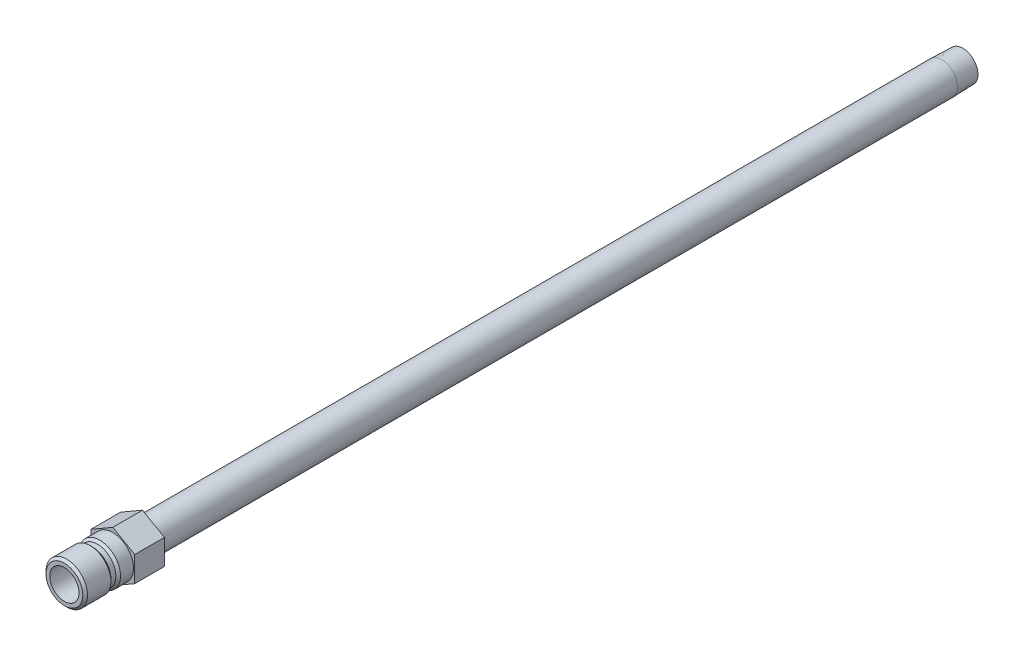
ISO-10303-21;
HEADER;
FILE_DESCRIPTION(('STEP AP214'),'2;1');
FILE_NAME('part.step','',(''),(''),'','','');
FILE_SCHEMA(('AUTOMOTIVE_DESIGN { 1 0 10303 214 1 1 1 1 }'));
ENDSEC;
DATA;
#1=APPLICATION_CONTEXT('core data for automotive mechanical design processes');
#2=APPLICATION_PROTOCOL_DEFINITION('international standard','automotive_design',2000,#1);
#3=PRODUCT_CONTEXT('',#1,'mechanical');
#4=PRODUCT('Part','Part','',(#3));
#5=PRODUCT_RELATED_PRODUCT_CATEGORY('part','',(#4));
#6=PRODUCT_DEFINITION_FORMATION('','',#4);
#7=PRODUCT_DEFINITION_CONTEXT('part definition',#1,'design');
#8=PRODUCT_DEFINITION('design','',#6,#7);
#9=PRODUCT_DEFINITION_SHAPE('','',#8);
#10=(LENGTH_UNIT() NAMED_UNIT(*) SI_UNIT(.MILLI.,.METRE.));
#11=(NAMED_UNIT(*) PLANE_ANGLE_UNIT() SI_UNIT($,.RADIAN.));
#12=(NAMED_UNIT(*) SI_UNIT($,.STERADIAN.) SOLID_ANGLE_UNIT());
#13=UNCERTAINTY_MEASURE_WITH_UNIT(LENGTH_MEASURE(1.E-05),#10,'distance_accuracy_value','');
#14=(GEOMETRIC_REPRESENTATION_CONTEXT(3) GLOBAL_UNCERTAINTY_ASSIGNED_CONTEXT((#13)) GLOBAL_UNIT_ASSIGNED_CONTEXT((#10,
#11,#12)) REPRESENTATION_CONTEXT('',''));
#15=CARTESIAN_POINT('',(0.,0.,0.));
#16=DIRECTION('',(0.,0.,1.));
#17=DIRECTION('',(1.,0.,0.));
#18=AXIS2_PLACEMENT_3D('',#15,#16,#17);
#19=CARTESIAN_POINT('',(0.,0.,-9.652));
#20=DIRECTION('',(0.,0.,-1.));
#21=DIRECTION('',(0.,1.,0.));
#22=AXIS2_PLACEMENT_3D('',#19,#20,#21);
#23=CYLINDRICAL_SURFACE('',#22,4.7625);
#24=CARTESIAN_POINT('',(0.,0.,3.556));
#25=DIRECTION('',(0.,0.,-1.));
#26=DIRECTION('',(0.,1.,0.));
#27=AXIS2_PLACEMENT_3D('',#24,#25,#26);
#28=CIRCLE('',#27,4.7625);
#29=CARTESIAN_POINT('',(0.,4.7625,3.556));
#30=VERTEX_POINT('',#29);
#31=EDGE_CURVE('E137',#30,#30,#28,.T.);
#32=ORIENTED_EDGE('',*,*,#31,.T.);
#33=EDGE_LOOP('',(#32));
#34=FACE_BOUND('',#33,.T.);
#35=CARTESIAN_POINT('',(0.,0.,15.748));
#36=DIRECTION('',(0.,0.,-1.));
#37=DIRECTION('',(0.,1.,0.));
#38=AXIS2_PLACEMENT_3D('',#35,#36,#37);
#39=CIRCLE('',#38,4.7625);
#40=CARTESIAN_POINT('',(0.,4.7625,15.748));
#41=VERTEX_POINT('',#40);
#42=EDGE_CURVE('E41',#41,#41,#39,.T.);
#43=ORIENTED_EDGE('',*,*,#42,.F.);
#44=EDGE_LOOP('',(#43));
#45=FACE_BOUND('',#44,.T.);
#46=ADVANCED_FACE('F33',(#34,#45),#23,.F.);
#47=CARTESIAN_POINT('',(0.,4.7625,15.748));
#48=DIRECTION('',(0.,0.,1.));
#49=DIRECTION('',(0.,-1.,0.));
#50=AXIS2_PLACEMENT_3D('',#47,#48,#49);
#51=PLANE('',#50);
#52=ORIENTED_EDGE('',*,*,#42,.T.);
#53=EDGE_LOOP('',(#52));
#54=FACE_BOUND('',#53,.T.);
#55=CARTESIAN_POINT('',(0.,0.,15.748));
#56=DIRECTION('',(0.,0.,-1.));
#57=DIRECTION('',(0.,1.,0.));
#58=AXIS2_PLACEMENT_3D('',#55,#56,#57);
#59=CIRCLE('',#58,5.9817);
#60=CARTESIAN_POINT('',(0.,5.9817,15.748));
#61=VERTEX_POINT('',#60);
#62=EDGE_CURVE('E175',#61,#61,#59,.T.);
#63=ORIENTED_EDGE('',*,*,#62,.F.);
#64=EDGE_LOOP('',(#63));
#65=FACE_BOUND('',#64,.T.);
#66=ADVANCED_FACE('F180',(#54,#65),#51,.T.);
#67=CARTESIAN_POINT('',(0.,0.,14.986));
#68=DIRECTION('',(0.,0.,-1.));
#69=DIRECTION('',(0.,1.,0.));
#70=AXIS2_PLACEMENT_3D('',#67,#68,#69);
#71=CONICAL_SURFACE('',#70,6.7437,0.785398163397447);
#72=ORIENTED_EDGE('',*,*,#62,.T.);
#73=EDGE_LOOP('',(#72));
#74=FACE_BOUND('',#73,.T.);
#75=CARTESIAN_POINT('',(0.,0.,14.986));
#76=DIRECTION('',(0.,0.,-1.));
#77=DIRECTION('',(0.,1.,0.));
#78=AXIS2_PLACEMENT_3D('',#75,#76,#77);
#79=CIRCLE('',#78,6.7437);
#80=CARTESIAN_POINT('',(0.,6.7437,14.986));
#81=VERTEX_POINT('',#80);
#82=EDGE_CURVE('E172',#81,#81,#79,.T.);
#83=ORIENTED_EDGE('',*,*,#82,.F.);
#84=EDGE_LOOP('',(#83));
#85=FACE_BOUND('',#84,.T.);
#86=ADVANCED_FACE('F188',(#74,#85),#71,.T.);
#87=CARTESIAN_POINT('',(0.,0.,-9.652));
#88=DIRECTION('',(0.,0.,-1.));
#89=DIRECTION('',(0.,1.,0.));
#90=AXIS2_PLACEMENT_3D('',#87,#88,#89);
#91=CYLINDRICAL_SURFACE('',#90,6.7437);
#92=ORIENTED_EDGE('',*,*,#82,.T.);
#93=EDGE_LOOP('',(#92));
#94=FACE_BOUND('',#93,.T.);
#95=CARTESIAN_POINT('',(0.,0.,7.366));
#96=DIRECTION('',(0.,0.,-1.));
#97=DIRECTION('',(0.,1.,0.));
#98=AXIS2_PLACEMENT_3D('',#95,#96,#97);
#99=CIRCLE('',#98,6.7437);
#100=CARTESIAN_POINT('',(0.,6.7437,7.366));
#101=VERTEX_POINT('',#100);
#102=EDGE_CURVE('E169',#101,#101,#99,.T.);
#103=ORIENTED_EDGE('',*,*,#102,.F.);
#104=EDGE_LOOP('',(#103));
#105=FACE_BOUND('',#104,.T.);
#106=ADVANCED_FACE('F237',(#94,#105),#91,.T.);
#107=CARTESIAN_POINT('',(0.,0.,6.604));
#108=DIRECTION('',(0.,0.,1.));
#109=DIRECTION('',(0.,-1.,0.));
#110=AXIS2_PLACEMENT_3D('',#107,#108,#109);
#111=CONICAL_SURFACE('',#110,5.9817,0.785398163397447);
#112=ORIENTED_EDGE('',*,*,#102,.T.);
#113=EDGE_LOOP('',(#112));
#114=FACE_BOUND('',#113,.T.);
#115=CARTESIAN_POINT('',(0.,0.,6.604));
#116=DIRECTION('',(0.,0.,-1.));
#117=DIRECTION('',(0.,1.,0.));
#118=AXIS2_PLACEMENT_3D('',#115,#116,#117);
#119=CIRCLE('',#118,5.9817);
#120=CARTESIAN_POINT('',(0.,5.9817,6.604));
#121=VERTEX_POINT('',#120);
#122=EDGE_CURVE('E166',#121,#121,#119,.T.);
#123=ORIENTED_EDGE('',*,*,#122,.F.);
#124=EDGE_LOOP('',(#123));
#125=FACE_BOUND('',#124,.T.);
#126=ADVANCED_FACE('F233',(#114,#125),#111,.T.);
#127=CARTESIAN_POINT('',(0.,0.,-9.652));
#128=DIRECTION('',(0.,0.,-1.));
#129=DIRECTION('',(0.,1.,0.));
#130=AXIS2_PLACEMENT_3D('',#127,#128,#129);
#131=CYLINDRICAL_SURFACE('',#130,5.9817);
#132=ORIENTED_EDGE('',*,*,#122,.T.);
#133=EDGE_LOOP('',(#132));
#134=FACE_BOUND('',#133,.T.);
#135=CARTESIAN_POINT('',(0.,0.,5.0165));
#136=DIRECTION('',(0.,0.,-1.));
#137=DIRECTION('',(0.,1.,0.));
#138=AXIS2_PLACEMENT_3D('',#135,#136,#137);
#139=CIRCLE('',#138,5.9817);
#140=CARTESIAN_POINT('',(0.,5.9817,5.0165));
#141=VERTEX_POINT('',#140);
#142=EDGE_CURVE('E163',#141,#141,#139,.T.);
#143=ORIENTED_EDGE('',*,*,#142,.F.);
#144=EDGE_LOOP('',(#143));
#145=FACE_BOUND('',#144,.T.);
#146=ADVANCED_FACE('F229',(#134,#145),#131,.T.);
#147=CARTESIAN_POINT('',(0.,0.,4.2545));
#148=DIRECTION('',(0.,0.,-1.));
#149=DIRECTION('',(0.,1.,0.));
#150=AXIS2_PLACEMENT_3D('',#147,#148,#149);
#151=CONICAL_SURFACE('',#150,6.7437,0.785398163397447);
#152=ORIENTED_EDGE('',*,*,#142,.T.);
#153=EDGE_LOOP('',(#152));
#154=FACE_BOUND('',#153,.T.);
#155=CARTESIAN_POINT('',(0.,0.,4.2545));
#156=DIRECTION('',(0.,0.,-1.));
#157=DIRECTION('',(0.,1.,0.));
#158=AXIS2_PLACEMENT_3D('',#155,#156,#157);
#159=CIRCLE('',#158,6.7437);
#160=CARTESIAN_POINT('',(0.,6.7437,4.2545));
#161=VERTEX_POINT('',#160);
#162=EDGE_CURVE('E160',#161,#161,#159,.T.);
#163=ORIENTED_EDGE('',*,*,#162,.F.);
#164=EDGE_LOOP('',(#163));
#165=FACE_BOUND('',#164,.T.);
#166=ADVANCED_FACE('F225',(#154,#165),#151,.T.);
#167=CARTESIAN_POINT('',(0.,0.,-9.652));
#168=DIRECTION('',(0.,0.,-1.));
#169=DIRECTION('',(0.,1.,0.));
#170=AXIS2_PLACEMENT_3D('',#167,#168,#169);
#171=CYLINDRICAL_SURFACE('',#170,6.7437);
#172=CARTESIAN_POINT('',(0.,0.,0.));
#173=DIRECTION('',(0.,0.,1.));
#174=DIRECTION('',(1.,0.,0.));
#175=AXIS2_PLACEMENT_3D('',#172,#173,#174);
#176=CIRCLE('',#175,6.7437);
#177=CARTESIAN_POINT('',(6.7437,0.,0.));
#178=VERTEX_POINT('',#177);
#179=EDGE_CURVE('E11',#178,#178,#176,.F.);
#180=ORIENTED_EDGE('',*,*,#179,.F.);
#181=EDGE_LOOP('',(#180));
#182=FACE_BOUND('',#181,.T.);
#183=ORIENTED_EDGE('',*,*,#162,.T.);
#184=EDGE_LOOP('',(#183));
#185=FACE_BOUND('',#184,.T.);
#186=ADVANCED_FACE('F221',(#182,#185),#171,.T.);
#187=CARTESIAN_POINT('',(0.,6.7437,-9.652));
#188=DIRECTION('',(0.,0.,-1.));
#189=DIRECTION('',(0.,1.,0.));
#190=AXIS2_PLACEMENT_3D('',#187,#188,#189);
#191=PLANE('',#190);
#192=CARTESIAN_POINT('',(0.,0.,-9.652));
#193=DIRECTION('',(0.,0.,-1.));
#194=DIRECTION('',(0.,1.,0.));
#195=AXIS2_PLACEMENT_3D('',#192,#193,#194);
#196=CIRCLE('',#195,5.1435);
#197=CARTESIAN_POINT('',(0.,5.1435,-9.652));
#198=VERTEX_POINT('',#197);
#199=EDGE_CURVE('E157',#198,#198,#196,.T.);
#200=ORIENTED_EDGE('',*,*,#199,.F.);
#201=EDGE_LOOP('',(#200));
#202=FACE_BOUND('',#201,.T.);
#203=DIRECTION('',(-0.866025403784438,-0.5,0.));
#204=VECTOR('',#203,1.);
#205=CARTESIAN_POINT('',(0.,8.21223022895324,-9.652));
#206=LINE('',#205,#204);
#207=CARTESIAN_POINT('',(0.,8.21223022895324,-9.652));
#208=VERTEX_POINT('',#207);
#209=CARTESIAN_POINT('',(-7.112,4.10611511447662,-9.652));
#210=VERTEX_POINT('',#209);
#211=EDGE_CURVE('E135',#208,#210,#206,.T.);
#212=ORIENTED_EDGE('',*,*,#211,.F.);
#213=DIRECTION('',(-0.866025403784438,0.5,0.));
#214=VECTOR('',#213,1.);
#215=CARTESIAN_POINT('',(7.112,4.10611511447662,-9.652));
#216=LINE('',#215,#214);
#217=CARTESIAN_POINT('',(7.112,4.10611511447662,-9.652));
#218=VERTEX_POINT('',#217);
#219=EDGE_CURVE('E110',#218,#208,#216,.T.);
#220=ORIENTED_EDGE('',*,*,#219,.F.);
#221=DIRECTION('',(0.,1.,0.));
#222=VECTOR('',#221,1.);
#223=CARTESIAN_POINT('',(7.112,-4.10611511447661,-9.652));
#224=LINE('',#223,#222);
#225=CARTESIAN_POINT('',(7.112,-4.10611511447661,-9.652));
#226=VERTEX_POINT('',#225);
#227=EDGE_CURVE('E95',#226,#218,#224,.T.);
#228=ORIENTED_EDGE('',*,*,#227,.F.);
#229=DIRECTION('',(0.866025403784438,0.5,0.));
#230=VECTOR('',#229,1.);
#231=CARTESIAN_POINT('',(0.,-8.21223022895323,-9.652));
#232=LINE('',#231,#230);
#233=CARTESIAN_POINT('',(0.,-8.21223022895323,-9.652));
#234=VERTEX_POINT('',#233);
#235=EDGE_CURVE('E108',#234,#226,#232,.T.);
#236=ORIENTED_EDGE('',*,*,#235,.F.);
#237=DIRECTION('',(0.866025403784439,-0.5,0.));
#238=VECTOR('',#237,1.);
#239=CARTESIAN_POINT('',(-7.112,-4.10611511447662,-9.652));
#240=LINE('',#239,#238);
#241=CARTESIAN_POINT('',(-7.112,-4.10611511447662,-9.652));
#242=VERTEX_POINT('',#241);
#243=EDGE_CURVE('E113',#242,#234,#240,.T.);
#244=ORIENTED_EDGE('',*,*,#243,.F.);
#245=DIRECTION('',(0.,-1.,0.));
#246=VECTOR('',#245,1.);
#247=CARTESIAN_POINT('',(-7.112,4.10611511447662,-9.652));
#248=LINE('',#247,#246);
#249=EDGE_CURVE('E115',#210,#242,#248,.T.);
#250=ORIENTED_EDGE('',*,*,#249,.F.);
#251=EDGE_LOOP('',(#212,#220,#228,#236,#244,#250));
#252=FACE_BOUND('',#251,.T.);
#253=ADVANCED_FACE('F106',(#202,#252),#191,.T.);
#254=CARTESIAN_POINT('',(0.,0.,-9.652));
#255=DIRECTION('',(0.,0.,-1.));
#256=DIRECTION('',(0.,1.,0.));
#257=AXIS2_PLACEMENT_3D('',#254,#255,#256);
#258=CYLINDRICAL_SURFACE('',#257,5.14349999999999);
#259=ORIENTED_EDGE('',*,*,#199,.T.);
#260=EDGE_LOOP('',(#259));
#261=FACE_BOUND('',#260,.T.);
#262=CARTESIAN_POINT('',(0.,0.,-269.494));
#263=DIRECTION('',(0.,0.,-1.));
#264=DIRECTION('',(0.,1.,0.));
#265=AXIS2_PLACEMENT_3D('',#262,#263,#264);
#266=CIRCLE('',#265,5.14349999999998);
#267=CARTESIAN_POINT('',(0.,5.1435,-269.494));
#268=VERTEX_POINT('',#267);
#269=EDGE_CURVE('E154',#268,#268,#266,.T.);
#270=ORIENTED_EDGE('',*,*,#269,.F.);
#271=EDGE_LOOP('',(#270));
#272=FACE_BOUND('',#271,.T.);
#273=ADVANCED_FACE('F214',(#261,#272),#258,.T.);
#274=CARTESIAN_POINT('',(0.,0.,-276.352));
#275=DIRECTION('',(0.,0.,1.));
#276=DIRECTION('',(0.,-1.,0.));
#277=AXIS2_PLACEMENT_3D('',#274,#275,#276);
#278=CONICAL_SURFACE('',#277,4.92918877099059,0.0312396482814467);
#279=ORIENTED_EDGE('',*,*,#269,.T.);
#280=EDGE_LOOP('',(#279));
#281=FACE_BOUND('',#280,.T.);
#282=CARTESIAN_POINT('',(0.,0.,-276.352));
#283=DIRECTION('',(0.,0.,-1.));
#284=DIRECTION('',(0.,1.,0.));
#285=AXIS2_PLACEMENT_3D('',#282,#283,#284);
#286=CIRCLE('',#285,4.92918877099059);
#287=CARTESIAN_POINT('',(0.,4.9291887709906,-276.352));
#288=VERTEX_POINT('',#287);
#289=EDGE_CURVE('E151',#288,#288,#286,.T.);
#290=ORIENTED_EDGE('',*,*,#289,.F.);
#291=EDGE_LOOP('',(#290));
#292=FACE_BOUND('',#291,.T.);
#293=ADVANCED_FACE('F210',(#281,#292),#278,.T.);
#294=CARTESIAN_POINT('',(0.,4.9291887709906,-276.352));
#295=DIRECTION('',(0.,0.,-1.));
#296=DIRECTION('',(0.,1.,0.));
#297=AXIS2_PLACEMENT_3D('',#294,#295,#296);
#298=PLANE('',#297);
#299=ORIENTED_EDGE('',*,*,#289,.T.);
#300=EDGE_LOOP('',(#299));
#301=FACE_BOUND('',#300,.T.);
#302=CARTESIAN_POINT('',(0.,0.,-276.352));
#303=DIRECTION('',(0.,0.,-1.));
#304=DIRECTION('',(0.,1.,0.));
#305=AXIS2_PLACEMENT_3D('',#302,#303,#304);
#306=CIRCLE('',#305,3.41629999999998);
#307=CARTESIAN_POINT('',(0.,3.4163,-276.352));
#308=VERTEX_POINT('',#307);
#309=EDGE_CURVE('E148',#308,#308,#306,.T.);
#310=ORIENTED_EDGE('',*,*,#309,.F.);
#311=EDGE_LOOP('',(#310));
#312=FACE_BOUND('',#311,.T.);
#313=ADVANCED_FACE('F203',(#301,#312),#298,.T.);
#314=CARTESIAN_POINT('',(0.,0.,-9.652));
#315=DIRECTION('',(0.,0.,-1.));
#316=DIRECTION('',(0.,1.,0.));
#317=AXIS2_PLACEMENT_3D('',#314,#315,#316);
#318=CYLINDRICAL_SURFACE('',#317,3.41629999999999);
#319=ORIENTED_EDGE('',*,*,#309,.T.);
#320=EDGE_LOOP('',(#319));
#321=FACE_BOUND('',#320,.T.);
#322=CARTESIAN_POINT('',(0.,0.,2.84021276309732));
#323=DIRECTION('',(0.,0.,-1.));
#324=DIRECTION('',(0.,1.,0.));
#325=AXIS2_PLACEMENT_3D('',#322,#323,#324);
#326=CIRCLE('',#325,3.4163);
#327=CARTESIAN_POINT('',(0.,3.4163,2.84021276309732));
#328=VERTEX_POINT('',#327);
#329=EDGE_CURVE('E145',#328,#328,#326,.T.);
#330=ORIENTED_EDGE('',*,*,#329,.F.);
#331=EDGE_LOOP('',(#330));
#332=FACE_BOUND('',#331,.T.);
#333=ADVANCED_FACE('F194',(#321,#332),#318,.F.);
#334=CARTESIAN_POINT('',(0.,0.,3.556));
#335=DIRECTION('',(0.,0.,1.));
#336=DIRECTION('',(0.,-1.,0.));
#337=AXIS2_PLACEMENT_3D('',#334,#335,#336);
#338=CONICAL_SURFACE('',#337,4.7625,1.08210413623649);
#339=ORIENTED_EDGE('',*,*,#329,.T.);
#340=EDGE_LOOP('',(#339));
#341=FACE_BOUND('',#340,.T.);
#342=ORIENTED_EDGE('',*,*,#31,.F.);
#343=EDGE_LOOP('',(#342));
#344=FACE_BOUND('',#343,.T.);
#345=ADVANCED_FACE('F191',(#341,#344),#338,.F.);
#346=CARTESIAN_POINT('',(0.,8.21223022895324,-9.652));
#347=DIRECTION('',(-0.5,0.866025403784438,0.));
#348=DIRECTION('',(-0.866025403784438,-0.5,0.));
#349=AXIS2_PLACEMENT_3D('',#346,#347,#348);
#350=PLANE('',#349);
#351=DIRECTION('',(-0.866025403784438,-0.5,0.));
#352=VECTOR('',#351,1.);
#353=CARTESIAN_POINT('',(0.,8.21223022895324,0.));
#354=LINE('',#353,#352);
#355=CARTESIAN_POINT('',(0.,8.21223022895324,0.));
#356=VERTEX_POINT('',#355);
#357=CARTESIAN_POINT('',(-7.112,4.10611511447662,0.));
#358=VERTEX_POINT('',#357);
#359=EDGE_CURVE('E120',#356,#358,#354,.T.);
#360=ORIENTED_EDGE('',*,*,#359,.F.);
#361=DIRECTION('',(0.,0.,1.));
#362=VECTOR('',#361,1.);
#363=CARTESIAN_POINT('',(0.,8.21223022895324,-9.652));
#364=LINE('',#363,#362);
#365=EDGE_CURVE('E49',#208,#356,#364,.T.);
#366=ORIENTED_EDGE('',*,*,#365,.F.);
#367=ORIENTED_EDGE('',*,*,#211,.T.);
#368=DIRECTION('',(0.,0.,1.));
#369=VECTOR('',#368,1.);
#370=CARTESIAN_POINT('',(-7.112,4.10611511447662,-9.652));
#371=LINE('',#370,#369);
#372=EDGE_CURVE('E84',#210,#358,#371,.T.);
#373=ORIENTED_EDGE('',*,*,#372,.T.);
#374=EDGE_LOOP('',(#360,#366,#367,#373));
#375=FACE_BOUND('',#374,.T.);
#376=ADVANCED_FACE('F193',(#375),#350,.T.);
#377=CARTESIAN_POINT('',(7.112,4.10611511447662,-9.652));
#378=DIRECTION('',(0.5,0.866025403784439,0.));
#379=DIRECTION('',(-0.866025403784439,0.5,0.));
#380=AXIS2_PLACEMENT_3D('',#377,#378,#379);
#381=PLANE('',#380);
#382=DIRECTION('',(-0.866025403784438,0.5,0.));
#383=VECTOR('',#382,1.);
#384=CARTESIAN_POINT('',(7.112,4.10611511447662,0.));
#385=LINE('',#384,#383);
#386=CARTESIAN_POINT('',(7.112,4.10611511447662,0.));
#387=VERTEX_POINT('',#386);
#388=EDGE_CURVE('E132',#387,#356,#385,.T.);
#389=ORIENTED_EDGE('',*,*,#388,.F.);
#390=DIRECTION('',(0.,0.,1.));
#391=VECTOR('',#390,1.);
#392=CARTESIAN_POINT('',(7.112,4.10611511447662,-9.652));
#393=LINE('',#392,#391);
#394=EDGE_CURVE('E72',#218,#387,#393,.T.);
#395=ORIENTED_EDGE('',*,*,#394,.F.);
#396=ORIENTED_EDGE('',*,*,#219,.T.);
#397=ORIENTED_EDGE('',*,*,#365,.T.);
#398=EDGE_LOOP('',(#389,#395,#396,#397));
#399=FACE_BOUND('',#398,.T.);
#400=ADVANCED_FACE('F201',(#399),#381,.T.);
#401=CARTESIAN_POINT('',(7.112,-4.10611511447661,-9.652));
#402=DIRECTION('',(1.,0.,0.));
#403=DIRECTION('',(0.,1.,0.));
#404=AXIS2_PLACEMENT_3D('',#401,#402,#403);
#405=PLANE('',#404);
#406=DIRECTION('',(0.,1.,0.));
#407=VECTOR('',#406,1.);
#408=CARTESIAN_POINT('',(7.112,-4.10611511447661,0.));
#409=LINE('',#408,#407);
#410=CARTESIAN_POINT('',(7.112,-4.10611511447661,0.));
#411=VERTEX_POINT('',#410);
#412=EDGE_CURVE('E97',#411,#387,#409,.T.);
#413=ORIENTED_EDGE('',*,*,#412,.F.);
#414=DIRECTION('',(0.,0.,1.));
#415=VECTOR('',#414,1.);
#416=CARTESIAN_POINT('',(7.112,-4.10611511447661,-9.652));
#417=LINE('',#416,#415);
#418=EDGE_CURVE('E92',#226,#411,#417,.T.);
#419=ORIENTED_EDGE('',*,*,#418,.F.);
#420=ORIENTED_EDGE('',*,*,#227,.T.);
#421=ORIENTED_EDGE('',*,*,#394,.T.);
#422=EDGE_LOOP('',(#413,#419,#420,#421));
#423=FACE_BOUND('',#422,.T.);
#424=ADVANCED_FACE('F94',(#423),#405,.T.);
#425=CARTESIAN_POINT('',(0.,-8.21223022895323,-9.652));
#426=DIRECTION('',(0.5,-0.866025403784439,0.));
#427=DIRECTION('',(0.866025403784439,0.5,0.));
#428=AXIS2_PLACEMENT_3D('',#425,#426,#427);
#429=PLANE('',#428);
#430=DIRECTION('',(0.866025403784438,0.5,0.));
#431=VECTOR('',#430,1.);
#432=CARTESIAN_POINT('',(0.,-8.21223022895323,0.));
#433=LINE('',#432,#431);
#434=CARTESIAN_POINT('',(0.,-8.21223022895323,0.));
#435=VERTEX_POINT('',#434);
#436=EDGE_CURVE('E129',#435,#411,#433,.T.);
#437=ORIENTED_EDGE('',*,*,#436,.F.);
#438=DIRECTION('',(0.,0.,1.));
#439=VECTOR('',#438,1.);
#440=CARTESIAN_POINT('',(0.,-8.21223022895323,-9.652));
#441=LINE('',#440,#439);
#442=EDGE_CURVE('E102',#234,#435,#441,.T.);
#443=ORIENTED_EDGE('',*,*,#442,.F.);
#444=ORIENTED_EDGE('',*,*,#235,.T.);
#445=ORIENTED_EDGE('',*,*,#418,.T.);
#446=EDGE_LOOP('',(#437,#443,#444,#445));
#447=FACE_BOUND('',#446,.T.);
#448=ADVANCED_FACE('F112',(#447),#429,.T.);
#449=CARTESIAN_POINT('',(-7.112,-4.10611511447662,-9.652));
#450=DIRECTION('',(-0.5,-0.866025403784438,0.));
#451=DIRECTION('',(0.866025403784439,-0.5,0.));
#452=AXIS2_PLACEMENT_3D('',#449,#450,#451);
#453=PLANE('',#452);
#454=DIRECTION('',(0.866025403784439,-0.5,0.));
#455=VECTOR('',#454,1.);
#456=CARTESIAN_POINT('',(-7.112,-4.10611511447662,0.));
#457=LINE('',#456,#455);
#458=CARTESIAN_POINT('',(-7.112,-4.10611511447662,0.));
#459=VERTEX_POINT('',#458);
#460=EDGE_CURVE('E126',#459,#435,#457,.T.);
#461=ORIENTED_EDGE('',*,*,#460,.F.);
#462=DIRECTION('',(0.,0.,1.));
#463=VECTOR('',#462,1.);
#464=CARTESIAN_POINT('',(-7.112,-4.10611511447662,-9.652));
#465=LINE('',#464,#463);
#466=EDGE_CURVE('E140',#242,#459,#465,.T.);
#467=ORIENTED_EDGE('',*,*,#466,.F.);
#468=ORIENTED_EDGE('',*,*,#243,.T.);
#469=ORIENTED_EDGE('',*,*,#442,.T.);
#470=EDGE_LOOP('',(#461,#467,#468,#469));
#471=FACE_BOUND('',#470,.T.);
#472=ADVANCED_FACE('F338',(#471),#453,.T.);
#473=CARTESIAN_POINT('',(-7.112,4.10611511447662,-9.652));
#474=DIRECTION('',(-1.,0.,0.));
#475=DIRECTION('',(0.,-1.,0.));
#476=AXIS2_PLACEMENT_3D('',#473,#474,#475);
#477=PLANE('',#476);
#478=DIRECTION('',(0.,-1.,0.));
#479=VECTOR('',#478,1.);
#480=CARTESIAN_POINT('',(-7.112,4.10611511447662,0.));
#481=LINE('',#480,#479);
#482=EDGE_CURVE('E123',#358,#459,#481,.T.);
#483=ORIENTED_EDGE('',*,*,#482,.F.);
#484=ORIENTED_EDGE('',*,*,#372,.F.);
#485=ORIENTED_EDGE('',*,*,#249,.T.);
#486=ORIENTED_EDGE('',*,*,#466,.T.);
#487=EDGE_LOOP('',(#483,#484,#485,#486));
#488=FACE_BOUND('',#487,.T.);
#489=ADVANCED_FACE('F346',(#488),#477,.T.);
#490=CARTESIAN_POINT('',(-7.112,4.10611511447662,0.));
#491=DIRECTION('',(0.,0.,1.));
#492=DIRECTION('',(1.,0.,0.));
#493=AXIS2_PLACEMENT_3D('',#490,#491,#492);
#494=PLANE('',#493);
#495=ORIENTED_EDGE('',*,*,#179,.T.);
#496=EDGE_LOOP('',(#495));
#497=FACE_BOUND('',#496,.T.);
#498=ORIENTED_EDGE('',*,*,#359,.T.);
#499=ORIENTED_EDGE('',*,*,#482,.T.);
#500=ORIENTED_EDGE('',*,*,#460,.T.);
#501=ORIENTED_EDGE('',*,*,#436,.T.);
#502=ORIENTED_EDGE('',*,*,#412,.T.);
#503=ORIENTED_EDGE('',*,*,#388,.T.);
#504=EDGE_LOOP('',(#498,#499,#500,#501,#502,#503));
#505=FACE_BOUND('',#504,.T.);
#506=ADVANCED_FACE('F355',(#497,#505),#494,.T.);
#507=CLOSED_SHELL('',(#46,#66,#86,#106,#126,#146,#166,#186,#253,#273,#293,#313,#333,#345,#376,
#400,#424,#448,#472,#489,#506));
#508=MANIFOLD_SOLID_BREP('B2',#507);
#509=ADVANCED_BREP_SHAPE_REPRESENTATION('',(#18,#508),#14);
#510=SHAPE_DEFINITION_REPRESENTATION(#9,#509);
ENDSEC;
END-ISO-10303-21;
